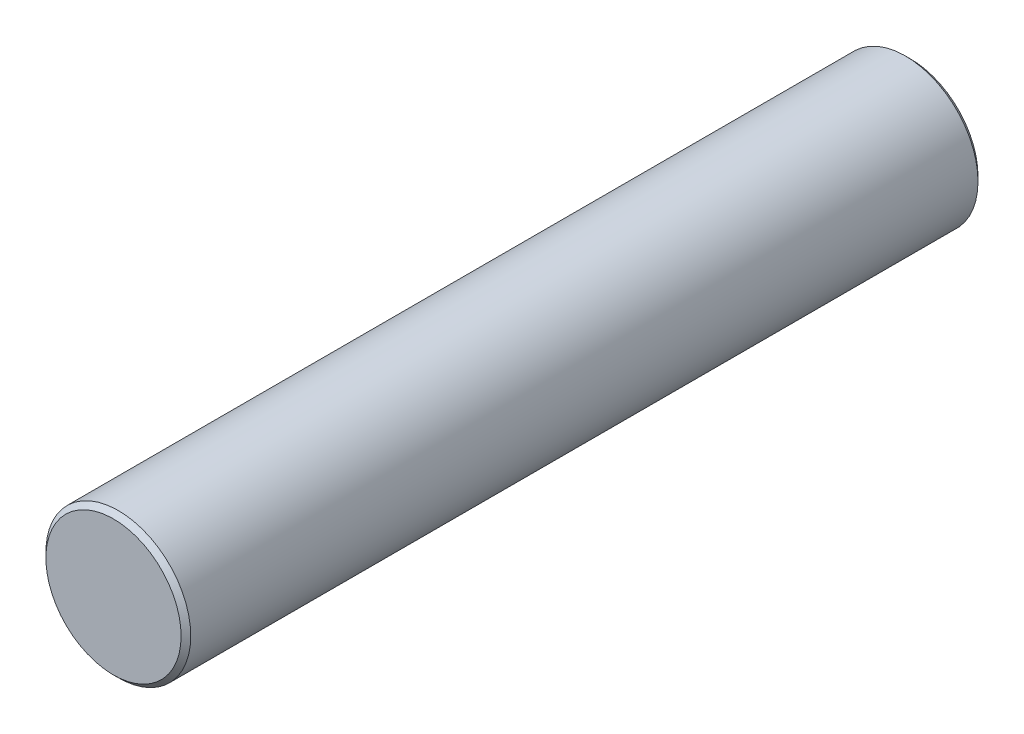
from build123d import *

# Parameters (mm, degrees)
SKETCH_1_R      = 1.5
EXTRUDE_1_DEPTH = 8.25
CHAMFER_1_SIZE  = 0.1


with BuildPart() as part:
    # Sketch 1 → Extrude 1 (new, symmetric)
    with BuildSketch(Plane.XY):
        Circle(SKETCH_1_R)
    extrude(amount=EXTRUDE_1_DEPTH, both=True)

    # Chamfer 1
    chamfer_1_edges = [part.edges().sort_by_distance(p)[0] for p in [
        (-1.5, 0, -8.25),
        (-1.5, 0, 8.25),
    ]]
    chamfer(chamfer_1_edges, length=CHAMFER_1_SIZE)


solid = part.part
